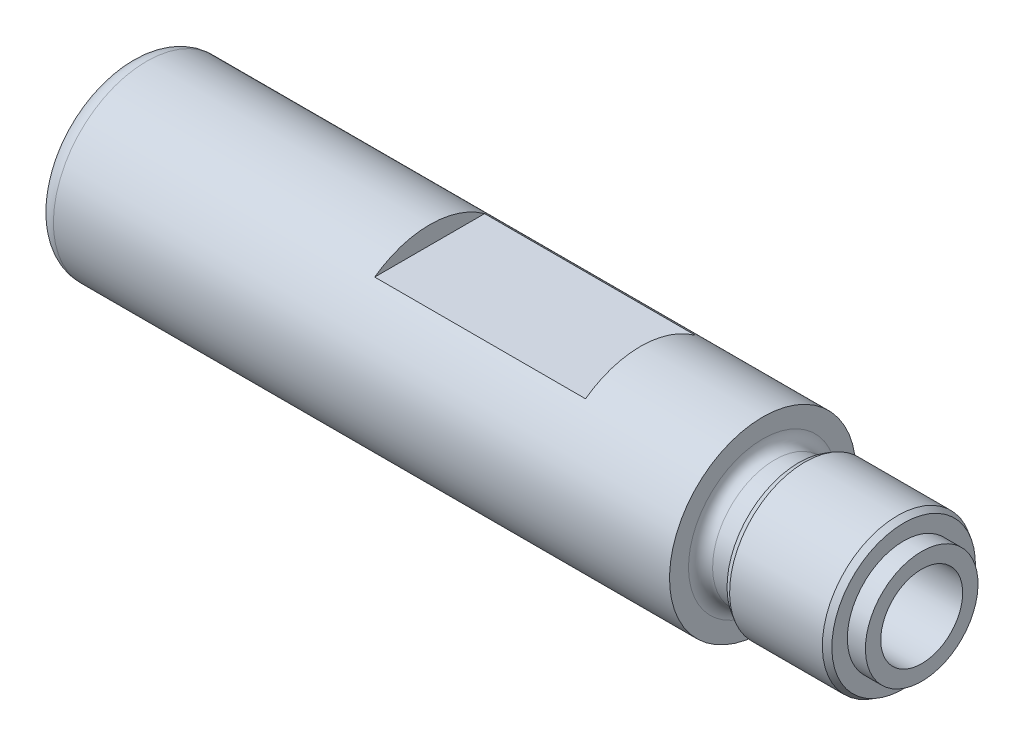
from build123d import *

# Parameters (mm, degrees)
SKETCH2_W          = 7.027329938
SKETCH2_H          = 1.708618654
SKETCH2_W_2        = 7.975094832
SKETCH2_H_2        = 1.004757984
CUT_EXTRUDE1_DEPTH = 8.89


with BuildPart() as part:
    # Sketch1 → Revolve1 (revolve)
    with BuildSketch(Plane.XY):
        with BuildLine():
            Line((-4.4196, 2.62128), (-4.4196, 3.028353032))
            Line((-4.4196, 3.028353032), (-4.1656, 3.175))
            Line((-4.1656, 3.175), (-0.254, 3.175))
            Line((-0.254, 3.175), (0, 3.028353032))
            Line((0, 3.028353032), (0, 2.3749))
            Line((0, 2.3749), (0.762, 2.3749))
            Line((0.762, 2.3749), (0.762, 1.7272))
            Line((0.762, 1.7272), (-30.9118, 1.7272))
            Line((-30.9118, 1.7272), (-30.9118, 1.3081))
            Line((-30.9118, 1.3081), (-32.6898, 1.3081))
            Line((-32.6898, 1.3081), (-32.6898, 3.16865))
            ThreePointArc((-32.6898, 3.16865), (-32.466615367, 3.707465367), (-31.9278, 3.93065))
            Line((-31.9278, 3.93065), (-5.9436, 3.93065))
            Line((-5.9436, 3.93065), (-5.9436, 3.12928))
            ThreePointArc((-5.9436, 3.12928), (-5.794810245, 2.770069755), (-5.4356, 2.62128))
            Line((-5.4356, 2.62128), (-4.4196, 2.62128))
        make_face()
    revolve(axis=Axis((0, 0, 0), (-1, 0, 0)))

    # Sketch2 → Cut-Extrude1 (cut)
    with BuildSketch(Plane.ZY.offset(11.0998)):
        with Locations((0, 4.029309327)):
            Rectangle(SKETCH2_W, SKETCH2_H)
        with Locations((0, -3.677378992)):
            Rectangle(SKETCH2_W_2, SKETCH2_H_2)
    extrude(amount=CUT_EXTRUDE1_DEPTH, mode=Mode.SUBTRACT)


solid = part.part
